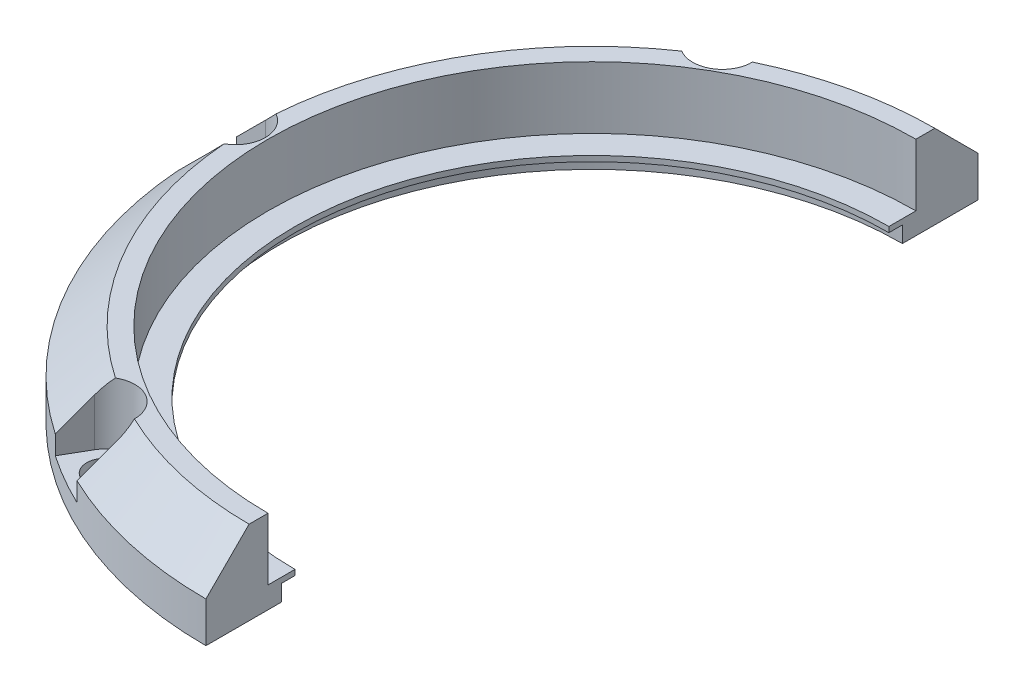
ISO-10303-21;
HEADER;
FILE_DESCRIPTION(('STEP AP214'),'2;1');
FILE_NAME('part.step','',(''),(''),'','','');
FILE_SCHEMA(('AUTOMOTIVE_DESIGN { 1 0 10303 214 1 1 1 1 }'));
ENDSEC;
DATA;
#1=APPLICATION_CONTEXT('core data for automotive mechanical design processes');
#2=APPLICATION_PROTOCOL_DEFINITION('international standard','automotive_design',2000,#1);
#3=PRODUCT_CONTEXT('',#1,'mechanical');
#4=PRODUCT('Part','Part','',(#3));
#5=PRODUCT_RELATED_PRODUCT_CATEGORY('part','',(#4));
#6=PRODUCT_DEFINITION_FORMATION('','',#4);
#7=PRODUCT_DEFINITION_CONTEXT('part definition',#1,'design');
#8=PRODUCT_DEFINITION('design','',#6,#7);
#9=PRODUCT_DEFINITION_SHAPE('','',#8);
#10=(LENGTH_UNIT() NAMED_UNIT(*) SI_UNIT(.MILLI.,.METRE.));
#11=(NAMED_UNIT(*) PLANE_ANGLE_UNIT() SI_UNIT($,.RADIAN.));
#12=(NAMED_UNIT(*) SI_UNIT($,.STERADIAN.) SOLID_ANGLE_UNIT());
#13=UNCERTAINTY_MEASURE_WITH_UNIT(LENGTH_MEASURE(1.E-05),#10,'distance_accuracy_value','');
#14=(GEOMETRIC_REPRESENTATION_CONTEXT(3) GLOBAL_UNCERTAINTY_ASSIGNED_CONTEXT((#13)) GLOBAL_UNIT_ASSIGNED_CONTEXT((#10,
#11,#12)) REPRESENTATION_CONTEXT('',''));
#15=CARTESIAN_POINT('',(0.,0.,0.));
#16=DIRECTION('',(0.,0.,1.));
#17=DIRECTION('',(1.,0.,0.));
#18=AXIS2_PLACEMENT_3D('',#15,#16,#17);
#19=CARTESIAN_POINT('',(0.,-10.51,-144.));
#20=DIRECTION('',(-1.,0.,0.));
#21=DIRECTION('',(0.,0.,1.));
#22=AXIS2_PLACEMENT_3D('',#19,#20,#21);
#23=PLANE('',#22);
#24=DIRECTION('',(0.,0.707106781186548,-0.707106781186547));
#25=VECTOR('',#24,1.);
#26=CARTESIAN_POINT('',(0.,68.5,-72.5));
#27=LINE('',#26,#25);
#28=CARTESIAN_POINT('',(0.,5.,-9.));
#29=VERTEX_POINT('',#28);
#30=CARTESIAN_POINT('',(0.,-3.,-1.));
#31=VERTEX_POINT('',#30);
#32=EDGE_CURVE('E305',#29,#31,#27,.F.);
#33=ORIENTED_EDGE('',*,*,#32,.T.);
#34=DIRECTION('',(0.,-1.,0.));
#35=VECTOR('',#34,1.);
#36=CARTESIAN_POINT('',(0.,-10.5,-1.00000000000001));
#37=LINE('',#36,#35);
#38=CARTESIAN_POINT('',(0.,-10.5,-1.));
#39=VERTEX_POINT('',#38);
#40=EDGE_CURVE('E308',#31,#39,#37,.T.);
#41=ORIENTED_EDGE('',*,*,#40,.T.);
#42=DIRECTION('',(0.,0.,-1.));
#43=VECTOR('',#42,1.);
#44=CARTESIAN_POINT('',(0.,-10.5,-1000.));
#45=LINE('',#44,#43);
#46=CARTESIAN_POINT('',(0.,-10.5,-15.));
#47=VERTEX_POINT('',#46);
#48=EDGE_CURVE('E467',#39,#47,#45,.T.);
#49=ORIENTED_EDGE('',*,*,#48,.T.);
#50=DIRECTION('',(0.,-1.,0.));
#51=VECTOR('',#50,1.);
#52=CARTESIAN_POINT('',(0.,-7.5,-15.));
#53=LINE('',#52,#51);
#54=CARTESIAN_POINT('',(0.,-7.5,-15.));
#55=VERTEX_POINT('',#54);
#56=EDGE_CURVE('E462',#55,#47,#53,.T.);
#57=ORIENTED_EDGE('',*,*,#56,.F.);
#58=DIRECTION('',(0.,0.,-1.));
#59=VECTOR('',#58,1.);
#60=CARTESIAN_POINT('',(0.,-7.5,-72.5));
#61=LINE('',#60,#59);
#62=CARTESIAN_POINT('',(0.,-7.5,-17.5));
#63=VERTEX_POINT('',#62);
#64=EDGE_CURVE('E26',#55,#63,#61,.T.);
#65=ORIENTED_EDGE('',*,*,#64,.T.);
#66=DIRECTION('',(0.,-1.,0.));
#67=VECTOR('',#66,1.);
#68=CARTESIAN_POINT('',(0.,-10.5,-17.5));
#69=LINE('',#68,#67);
#70=CARTESIAN_POINT('',(0.,-6.5,-17.5));
#71=VERTEX_POINT('',#70);
#72=EDGE_CURVE('E34',#63,#71,#69,.F.);
#73=ORIENTED_EDGE('',*,*,#72,.T.);
#74=DIRECTION('',(0.,0.,1.));
#75=VECTOR('',#74,1.);
#76=CARTESIAN_POINT('',(0.,-6.5,-12.5));
#77=LINE('',#76,#75);
#78=CARTESIAN_POINT('',(0.,-6.5,-12.5));
#79=VERTEX_POINT('',#78);
#80=EDGE_CURVE('E479',#71,#79,#77,.T.);
#81=ORIENTED_EDGE('',*,*,#80,.T.);
#82=DIRECTION('',(0.,-1.,0.));
#83=VECTOR('',#82,1.);
#84=CARTESIAN_POINT('',(0.,-10.5,-12.5));
#85=LINE('',#84,#83);
#86=CARTESIAN_POINT('',(0.,5.,-12.5));
#87=VERTEX_POINT('',#86);
#88=EDGE_CURVE('E485',#79,#87,#85,.F.);
#89=ORIENTED_EDGE('',*,*,#88,.T.);
#90=DIRECTION('',(0.,0.,1.));
#91=VECTOR('',#90,1.);
#92=CARTESIAN_POINT('',(0.,5.,-9.));
#93=LINE('',#92,#91);
#94=EDGE_CURVE('E311',#87,#29,#93,.T.);
#95=ORIENTED_EDGE('',*,*,#94,.T.);
#96=EDGE_LOOP('',(#33,#41,#49,#57,#65,#73,#81,#89,#95));
#97=FACE_BOUND('',#96,.T.);
#98=ADVANCED_FACE('F17',(#97),#23,.F.);
#99=DIRECTION('',(0.,-0.707106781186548,-0.707106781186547));
#100=VECTOR('',#99,1.);
#101=CARTESIAN_POINT('',(0.,68.5,-72.5));
#102=LINE('',#101,#100);
#103=CARTESIAN_POINT('',(0.,-3.,-144.));
#104=VERTEX_POINT('',#103);
#105=CARTESIAN_POINT('',(0.,5.,-136.));
#106=VERTEX_POINT('',#105);
#107=EDGE_CURVE('E21',#104,#106,#102,.F.);
#108=ORIENTED_EDGE('',*,*,#107,.T.);
#109=CARTESIAN_POINT('',(0.,5.,-132.5));
#110=VERTEX_POINT('',#109);
#111=EDGE_CURVE('E468',#106,#110,#93,.T.);
#112=ORIENTED_EDGE('',*,*,#111,.T.);
#113=DIRECTION('',(0.,-1.,0.));
#114=VECTOR('',#113,1.);
#115=CARTESIAN_POINT('',(0.,-10.5,-132.5));
#116=LINE('',#115,#114);
#117=CARTESIAN_POINT('',(0.,-6.5,-132.5));
#118=VERTEX_POINT('',#117);
#119=EDGE_CURVE('E482',#110,#118,#116,.T.);
#120=ORIENTED_EDGE('',*,*,#119,.T.);
#121=CARTESIAN_POINT('',(0.,-6.5,-127.5));
#122=VERTEX_POINT('',#121);
#123=EDGE_CURVE('E470',#118,#122,#77,.T.);
#124=ORIENTED_EDGE('',*,*,#123,.T.);
#125=DIRECTION('',(0.,-1.,0.));
#126=VECTOR('',#125,1.);
#127=CARTESIAN_POINT('',(0.,-10.5,-127.5));
#128=LINE('',#127,#126);
#129=CARTESIAN_POINT('',(0.,-7.5,-127.5));
#130=VERTEX_POINT('',#129);
#131=EDGE_CURVE('E474',#122,#130,#128,.T.);
#132=ORIENTED_EDGE('',*,*,#131,.T.);
#133=CARTESIAN_POINT('',(0.,-7.5,-130.));
#134=VERTEX_POINT('',#133);
#135=EDGE_CURVE('E11',#130,#134,#61,.T.);
#136=ORIENTED_EDGE('',*,*,#135,.T.);
#137=DIRECTION('',(0.,-1.,0.));
#138=VECTOR('',#137,1.);
#139=CARTESIAN_POINT('',(0.,-7.5,-130.));
#140=LINE('',#139,#138);
#141=CARTESIAN_POINT('',(0.,-10.5,-130.));
#142=VERTEX_POINT('',#141);
#143=EDGE_CURVE('E472',#142,#134,#140,.F.);
#144=ORIENTED_EDGE('',*,*,#143,.F.);
#145=CARTESIAN_POINT('',(0.,-10.5,-144.));
#146=VERTEX_POINT('',#145);
#147=EDGE_CURVE('E475',#142,#146,#45,.T.);
#148=ORIENTED_EDGE('',*,*,#147,.T.);
#149=DIRECTION('',(0.,-1.,0.));
#150=VECTOR('',#149,1.);
#151=CARTESIAN_POINT('',(0.,-10.5,-144.));
#152=LINE('',#151,#150);
#153=EDGE_CURVE('E314',#146,#104,#152,.F.);
#154=ORIENTED_EDGE('',*,*,#153,.T.);
#155=EDGE_LOOP('',(#108,#112,#120,#124,#132,#136,#144,#148,#154));
#156=FACE_BOUND('',#155,.T.);
#157=ADVANCED_FACE('F19',(#156),#23,.F.);
#158=CARTESIAN_POINT('',(0.,-10.5,-72.5));
#159=DIRECTION('',(0.,-1.,0.));
#160=DIRECTION('',(0.,0.,-1.));
#161=AXIS2_PLACEMENT_3D('',#158,#159,#160);
#162=CYLINDRICAL_SURFACE('',#161,55.);
#163=ORIENTED_EDGE('',*,*,#131,.F.);
#164=CARTESIAN_POINT('',(0.,-6.5,-72.5));
#165=DIRECTION('',(0.,-1.,0.));
#166=DIRECTION('',(0.,0.,-1.));
#167=AXIS2_PLACEMENT_3D('',#164,#165,#166);
#168=CIRCLE('',#167,55.);
#169=EDGE_CURVE('E353',#71,#122,#168,.T.);
#170=ORIENTED_EDGE('',*,*,#169,.F.);
#171=ORIENTED_EDGE('',*,*,#72,.F.);
#172=CARTESIAN_POINT('',(0.,-7.5,-72.5));
#173=DIRECTION('',(0.,-1.,0.));
#174=DIRECTION('',(1.,0.,0.));
#175=AXIS2_PLACEMENT_3D('',#172,#173,#174);
#176=CIRCLE('',#175,55.);
#177=EDGE_CURVE('E463',#63,#130,#176,.T.);
#178=ORIENTED_EDGE('',*,*,#177,.T.);
#179=EDGE_LOOP('',(#163,#170,#171,#178));
#180=FACE_BOUND('',#179,.T.);
#181=ADVANCED_FACE('F273',(#180),#162,.F.);
#182=CARTESIAN_POINT('',(0.,-3.,-72.5));
#183=DIRECTION('',(0.,-1.,0.));
#184=DIRECTION('',(0.,0.,-1.));
#185=AXIS2_PLACEMENT_3D('',#182,#183,#184);
#186=CONICAL_SURFACE('',#185,71.5,0.785398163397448);
#187=ORIENTED_EDGE('',*,*,#107,.F.);
#188=CARTESIAN_POINT('',(0.,-3.,-72.5));
#189=DIRECTION('',(0.,-1.,0.));
#190=DIRECTION('',(0.,0.,-1.));
#191=AXIS2_PLACEMENT_3D('',#188,#189,#190);
#192=CIRCLE('',#191,71.5);
#193=CARTESIAN_POINT('',(-30.8809341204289,-3.,-136.98734688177));
#194=VERTEX_POINT('',#193);
#195=EDGE_CURVE('E326',#194,#104,#192,.T.);
#196=ORIENTED_EDGE('',*,*,#195,.F.);
#197=CARTESIAN_POINT('',(-30.8810344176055,-3.0002,-136.987520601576));
#198=CARTESIAN_POINT('',(-30.4403735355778,-2.12148155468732,-136.224273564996));
#199=CARTESIAN_POINT('',(-29.999685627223,-1.24281733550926,-135.460979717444));
#200=CARTESIAN_POINT('',(-29.1182557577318,0.514402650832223,-133.934298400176));
#201=CARTESIAN_POINT('',(-28.6775137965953,1.3929584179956,-133.17091093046));
#202=CARTESIAN_POINT('',(-28.2367448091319,2.27145995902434,-132.407476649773));
#203=B_SPLINE_CURVE_WITH_KNOTS('',3,(#197,#198,#199,#200,#201,#202),.UNSPECIFIED.,.F.,.F.,(4,2,
4),(0.,3.7336131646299,7.46722633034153),.UNSPECIFIED.);
#204=CARTESIAN_POINT('',(-28.2368602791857,2.27122981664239,-132.407676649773));
#205=VERTEX_POINT('',#204);
#206=EDGE_CURVE('E358',#194,#205,#203,.T.);
#207=ORIENTED_EDGE('',*,*,#206,.T.);
#208=CARTESIAN_POINT('',(-28.2369757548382,2.27099967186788,-132.407876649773));
#209=CARTESIAN_POINT('',(-28.179010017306,2.38653079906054,-132.307475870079));
#210=CARTESIAN_POINT('',(-28.1242922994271,2.50219936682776,-132.20539215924));
#211=CARTESIAN_POINT('',(-28.0214365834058,2.73361073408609,-131.998042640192));
#212=CARTESIAN_POINT('',(-27.9732986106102,2.84935353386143,-131.892776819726));
#213=CARTESIAN_POINT('',(-27.8396492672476,3.19440609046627,-131.574314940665));
#214=CARTESIAN_POINT('',(-27.7639059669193,3.42352923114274,-131.356724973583));
#215=CARTESIAN_POINT('',(-27.6397802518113,3.87931299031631,-130.911277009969));
#216=CARTESIAN_POINT('',(-27.5914017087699,4.10597325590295,-130.683417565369));
#217=CARTESIAN_POINT('',(-27.5404716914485,4.44330915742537,-130.334101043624));
#218=CARTESIAN_POINT('',(-27.5270912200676,4.55578485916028,-130.215888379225));
#219=CARTESIAN_POINT('',(-27.5079987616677,4.77921615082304,-129.977387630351));
#220=CARTESIAN_POINT('',(-27.5022881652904,4.89017146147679,-129.857099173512));
#221=CARTESIAN_POINT('',(-27.5005557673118,5.00019999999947,-129.735863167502));
#222=B_SPLINE_CURVE_WITH_KNOTS('',3,(#208,#209,#210,#211,#212,#213,#214,#215,#216,#217,#218,
#219,#220,#221),.UNSPECIFIED.,.F.,.F.,(4,2,2,2,2,2,4),(0.,0.490926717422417,0.981855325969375,
1.955288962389,2.92886029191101,3.41984219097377,3.91091309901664),.UNSPECIFIED.);
#223=CARTESIAN_POINT('',(-27.5005589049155,5.,-129.736083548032));
#224=VERTEX_POINT('',#223);
#225=EDGE_CURVE('E189',#205,#224,#222,.T.);
#226=ORIENTED_EDGE('',*,*,#225,.T.);
#227=CARTESIAN_POINT('',(0.,5.,-72.5));
#228=DIRECTION('',(0.,-1.,0.));
#229=DIRECTION('',(0.,0.,-1.));
#230=AXIS2_PLACEMENT_3D('',#227,#228,#229);
#231=CIRCLE('',#230,63.5);
#232=EDGE_CURVE('E338',#224,#106,#231,.T.);
#233=ORIENTED_EDGE('',*,*,#232,.T.);
#234=EDGE_LOOP('',(#187,#196,#207,#226,#233));
#235=FACE_BOUND('',#234,.T.);
#236=ADVANCED_FACE('F259',(#235),#186,.T.);
#237=CARTESIAN_POINT('',(-63.3181818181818,5.,-77.3018591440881));
#238=VERTEX_POINT('',#237);
#239=CARTESIAN_POINT('',(-35.8176229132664,5.,-124.934224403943));
#240=VERTEX_POINT('',#239);
#241=EDGE_CURVE('E341',#238,#240,#231,.T.);
#242=ORIENTED_EDGE('',*,*,#241,.T.);
#243=CARTESIAN_POINT('',(-35.8174336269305,5.0002,-124.934111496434));
#244=CARTESIAN_POINT('',(-35.9215672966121,4.89016468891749,-124.996233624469));
#245=CARTESIAN_POINT('',(-36.0228909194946,4.77920249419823,-125.061327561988));
#246=CARTESIAN_POINT('',(-36.2199038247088,4.55575727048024,-125.197121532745));
#247=CARTESIAN_POINT('',(-36.3155941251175,4.44327452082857,-125.267820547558));
#248=CARTESIAN_POINT('',(-36.592660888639,4.10591764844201,-125.486600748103));
#249=CARTESIAN_POINT('',(-36.7658121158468,3.8792432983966,-125.642438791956));
#250=CARTESIAN_POINT('',(-37.0895325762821,3.42343132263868,-125.972683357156));
#251=CARTESIAN_POINT('',(-37.2401050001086,3.19429404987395,-126.147087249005));
#252=CARTESIAN_POINT('',(-37.4490827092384,2.84922032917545,-126.422083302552));
#253=CARTESIAN_POINT('',(-37.5161783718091,2.73347039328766,-126.516412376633));
#254=CARTESIAN_POINT('',(-37.6443232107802,2.50204485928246,-126.709178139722));
#255=CARTESIAN_POINT('',(-37.7053724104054,2.3863692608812,-126.807614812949));
#256=CARTESIAN_POINT('',(-37.7633397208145,2.27083117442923,-126.908023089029));
#257=B_SPLINE_CURVE_WITH_KNOTS('',3,(#243,#244,#245,#246,#247,#248,#249,#250,#251,#252,#253,
#254,#255,#256),.UNSPECIFIED.,.F.,.F.,(4,2,2,2,2,2,4),(0.,0.491101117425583,0.982113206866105,
1.95574343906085,2.92923595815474,3.42019474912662,3.91115165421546),.UNSPECIFIED.);
#258=CARTESIAN_POINT('',(-37.7631397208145,2.27122981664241,-126.907676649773));
#259=VERTEX_POINT('',#258);
#260=EDGE_CURVE('E383',#240,#259,#257,.T.);
#261=ORIENTED_EDGE('',*,*,#260,.T.);
#262=CARTESIAN_POINT('',(-37.7630242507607,2.27145995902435,-126.907476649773));
#263=CARTESIAN_POINT('',(-38.2037932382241,1.3929584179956,-127.67091093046));
#264=CARTESIAN_POINT('',(-38.6445351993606,0.514402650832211,-128.434298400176));
#265=CARTESIAN_POINT('',(-39.5259650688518,-1.24281733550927,-129.960979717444));
#266=CARTESIAN_POINT('',(-39.9666529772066,-2.12148155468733,-130.724273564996));
#267=CARTESIAN_POINT('',(-40.4073138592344,-3.0002,-131.487520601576));
#268=B_SPLINE_CURVE_WITH_KNOTS('',3,(#262,#263,#264,#265,#266,#267),.UNSPECIFIED.,.F.,.F.,(4,2,
4),(0.,3.73361316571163,7.46722633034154),.UNSPECIFIED.);
#269=CARTESIAN_POINT('',(-40.4072135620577,-3.,-131.48734688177));
#270=VERTEX_POINT('',#269);
#271=EDGE_CURVE('E364',#259,#270,#268,.T.);
#272=ORIENTED_EDGE('',*,*,#271,.T.);
#273=CARTESIAN_POINT('',(-71.2881476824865,-3.,-78.));
#274=VERTEX_POINT('',#273);
#275=EDGE_CURVE('E331',#274,#270,#192,.T.);
#276=ORIENTED_EDGE('',*,*,#275,.F.);
#277=CARTESIAN_POINT('',(-80.8781602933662,-12.5649542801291,-77.9999999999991));
#278=CARTESIAN_POINT('',(-78.8401535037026,-10.5316539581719,-77.9999999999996));
#279=CARTESIAN_POINT('',(-76.8019801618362,-8.49852053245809,-77.9999999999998));
#280=CARTESIAN_POINT('',(-72.7251831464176,-4.43270559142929,-78.));
#281=CARTESIAN_POINT('',(-70.6865594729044,-2.40002407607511,-78.));
#282=CARTESIAN_POINT('',(-66.6087441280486,1.6647693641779,-78.));
#283=CARTESIAN_POINT('',(-64.5695524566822,3.69688128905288,-78.));
#284=CARTESIAN_POINT('',(-60.4903984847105,7.76033186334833,-78.0000000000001));
#285=CARTESIAN_POINT('',(-58.4504361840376,9.79167051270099,-78.0000000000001));
#286=CARTESIAN_POINT('',(-56.4099873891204,11.8225205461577,-78.));
#287=B_SPLINE_CURVE_WITH_KNOTS('',3,(#277,#278,#279,#280,#281,#282,#283,#284,#285,#286),
.UNSPECIFIED.,.F.,.F.,(4,2,2,2,4),(0.,8.63655240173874,17.2731040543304,25.9096560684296,
34.5462088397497),.UNSPECIFIED.);
#288=CARTESIAN_POINT('',(-66.,2.27122981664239,-78.));
#289=VERTEX_POINT('',#288);
#290=EDGE_CURVE('E495',#274,#289,#287,.T.);
#291=ORIENTED_EDGE('',*,*,#290,.T.);
#292=CARTESIAN_POINT('',(-66.0002,2.27103050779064,-77.9999999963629));
#293=CARTESIAN_POINT('',(-65.8842688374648,2.38656036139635,-77.9999987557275));
#294=CARTESIAN_POINT('',(-65.768504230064,2.50222764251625,-77.9963432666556));
#295=CARTESIAN_POINT('',(-65.5375091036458,2.73363641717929,-77.9817432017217));
#296=CARTESIAN_POINT('',(-65.4222785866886,2.84937791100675,-77.9707985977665));
#297=CARTESIAN_POINT('',(-65.07966180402,3.19442659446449,-77.9273104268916));
#298=CARTESIAN_POINT('',(-64.8533543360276,3.42354714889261,-77.8841107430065));
#299=CARTESIAN_POINT('',(-64.4055274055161,3.87932574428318,-77.7688827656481));
#300=CARTESIAN_POINT('',(-64.1840086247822,4.10598343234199,-77.6968503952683));
#301=CARTESIAN_POINT('',(-63.856030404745,4.44331549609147,-77.5662997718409));
#302=CARTESIAN_POINT('',(-63.7469662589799,4.55578990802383,-77.5187816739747));
#303=CARTESIAN_POINT('',(-63.5308748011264,4.77921865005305,-77.416066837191));
#304=CARTESIAN_POINT('',(-63.4238478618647,4.89017270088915,-77.3608687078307));
#305=CARTESIAN_POINT('',(-63.317989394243,5.00019999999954,-77.3017516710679));
#306=B_SPLINE_CURVE_WITH_KNOTS('',3,(#292,#293,#294,#295,#296,#297,#298,#299,#300,#301,#302,
#303,#304,#305),.UNSPECIFIED.,.F.,.F.,(4,2,2,2,2,2,4),(0.,0.490921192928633,0.981844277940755,
1.95526713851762,2.92882768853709,3.41980406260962,3.91086944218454),.UNSPECIFIED.);
#307=EDGE_CURVE('E419',#289,#238,#306,.T.);
#308=ORIENTED_EDGE('',*,*,#307,.T.);
#309=EDGE_LOOP('',(#242,#261,#272,#276,#291,#308));
#310=FACE_BOUND('',#309,.T.);
#311=ADVANCED_FACE('F491',(#310),#186,.T.);
#312=CARTESIAN_POINT('',(-35.8176229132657,5.,-20.0657755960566));
#313=VERTEX_POINT('',#312);
#314=CARTESIAN_POINT('',(-63.3181818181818,5.,-67.6981408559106));
#315=VERTEX_POINT('',#314);
#316=EDGE_CURVE('E337',#313,#315,#231,.T.);
#317=ORIENTED_EDGE('',*,*,#316,.T.);
#318=CARTESIAN_POINT('',(-63.3179893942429,5.0001999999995,-67.6982483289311));
#319=CARTESIAN_POINT('',(-63.4238478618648,4.89017270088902,-67.6391312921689));
#320=CARTESIAN_POINT('',(-63.5308748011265,4.77921865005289,-67.5839331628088));
#321=CARTESIAN_POINT('',(-63.7469662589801,4.55578990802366,-67.4812183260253));
#322=CARTESIAN_POINT('',(-63.8560304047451,4.44331549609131,-67.433700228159));
#323=CARTESIAN_POINT('',(-64.1840086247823,4.10598343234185,-67.3031496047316));
#324=CARTESIAN_POINT('',(-64.4055274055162,3.87932574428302,-67.2311172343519));
#325=CARTESIAN_POINT('',(-64.8533543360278,3.42354714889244,-67.1158892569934));
#326=CARTESIAN_POINT('',(-65.0796618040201,3.19442659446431,-67.0726895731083));
#327=CARTESIAN_POINT('',(-65.4222785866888,2.84937791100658,-67.0292014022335));
#328=CARTESIAN_POINT('',(-65.537509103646,2.73363641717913,-67.0182567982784));
#329=CARTESIAN_POINT('',(-65.7685042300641,2.50222764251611,-67.0036567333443));
#330=CARTESIAN_POINT('',(-65.8842688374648,2.38656036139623,-67.000001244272));
#331=CARTESIAN_POINT('',(-66.0002,2.27103050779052,-67.0000000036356));
#332=B_SPLINE_CURVE_WITH_KNOTS('',3,(#318,#319,#320,#321,#322,#323,#324,#325,#326,#327,#328,
#329,#330,#331),.UNSPECIFIED.,.F.,.F.,(4,2,2,2,2,2,4),(0.,0.491065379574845,0.982041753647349,
1.95560230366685,2.92902516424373,3.41994824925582,3.91086944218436),.UNSPECIFIED.);
#333=CARTESIAN_POINT('',(-66.,2.2712298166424,-67.));
#334=VERTEX_POINT('',#333);
#335=EDGE_CURVE('E423',#315,#334,#332,.T.);
#336=ORIENTED_EDGE('',*,*,#335,.T.);
#337=CARTESIAN_POINT('',(-56.4099873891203,11.8225205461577,-67.));
#338=CARTESIAN_POINT('',(-58.4504361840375,9.79167051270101,-67.0000000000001));
#339=CARTESIAN_POINT('',(-60.4903984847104,7.76033186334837,-67.0000000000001));
#340=CARTESIAN_POINT('',(-64.5695524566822,3.69688128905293,-67.));
#341=CARTESIAN_POINT('',(-66.6087441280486,1.66476936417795,-67.));
#342=CARTESIAN_POINT('',(-70.6865594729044,-2.40002407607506,-67.));
#343=CARTESIAN_POINT('',(-72.7251831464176,-4.43270559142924,-67.));
#344=CARTESIAN_POINT('',(-76.8019801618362,-8.49852053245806,-66.9999999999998));
#345=CARTESIAN_POINT('',(-78.8401535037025,-10.5316539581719,-66.9999999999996));
#346=CARTESIAN_POINT('',(-80.8781602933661,-12.5649542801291,-66.9999999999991));
#347=B_SPLINE_CURVE_WITH_KNOTS('',3,(#337,#338,#339,#340,#341,#342,#343,#344,#345,#346),
.UNSPECIFIED.,.F.,.F.,(4,2,2,2,4),(0.,8.6365527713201,17.2731047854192,25.9096564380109,
34.5462088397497),.UNSPECIFIED.);
#348=CARTESIAN_POINT('',(-71.2881476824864,-3.,-66.9999999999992));
#349=VERTEX_POINT('',#348);
#350=EDGE_CURVE('E496',#334,#349,#347,.T.);
#351=ORIENTED_EDGE('',*,*,#350,.T.);
#352=CARTESIAN_POINT('',(-40.4072135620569,-3.,-13.5126531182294));
#353=VERTEX_POINT('',#352);
#354=EDGE_CURVE('E324',#353,#349,#192,.T.);
#355=ORIENTED_EDGE('',*,*,#354,.F.);
#356=CARTESIAN_POINT('',(-40.4073138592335,-3.0002,-13.5124793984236));
#357=CARTESIAN_POINT('',(-39.9666529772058,-2.12148155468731,-14.2757264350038));
#358=CARTESIAN_POINT('',(-39.525965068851,-1.24281733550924,-15.0390202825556));
#359=CARTESIAN_POINT('',(-38.6445351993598,0.514402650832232,-16.5657015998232));
#360=CARTESIAN_POINT('',(-38.2037932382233,1.3929584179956,-17.3290890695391));
#361=CARTESIAN_POINT('',(-37.7630242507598,2.27145995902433,-18.0925233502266));
#362=B_SPLINE_CURVE_WITH_KNOTS('',3,(#356,#357,#358,#359,#360,#361),.UNSPECIFIED.,.F.,.F.,(4,2,
4),(0.,3.73361316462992,7.46722633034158),.UNSPECIFIED.);
#363=CARTESIAN_POINT('',(-37.7631397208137,2.27122981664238,-18.0923233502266));
#364=VERTEX_POINT('',#363);
#365=EDGE_CURVE('E397',#353,#364,#362,.T.);
#366=ORIENTED_EDGE('',*,*,#365,.T.);
#367=CARTESIAN_POINT('',(-37.7633397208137,2.27083117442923,-18.0919769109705));
#368=CARTESIAN_POINT('',(-37.7053724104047,2.38636926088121,-18.1923851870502));
#369=CARTESIAN_POINT('',(-37.6443232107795,2.50204485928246,-18.2908218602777));
#370=CARTESIAN_POINT('',(-37.5161783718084,2.73347039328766,-18.4835876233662));
#371=CARTESIAN_POINT('',(-37.4490827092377,2.84922032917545,-18.5779166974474));
#372=CARTESIAN_POINT('',(-37.2401050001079,3.19429404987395,-18.8529127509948));
#373=CARTESIAN_POINT('',(-37.0895325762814,3.42343132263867,-19.027316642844));
#374=CARTESIAN_POINT('',(-36.7658121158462,3.87924329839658,-19.3575612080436));
#375=CARTESIAN_POINT('',(-36.5926608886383,4.105917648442,-19.5133992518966));
#376=CARTESIAN_POINT('',(-36.3155941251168,4.44327452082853,-19.732179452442));
#377=CARTESIAN_POINT('',(-36.2199038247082,4.5557572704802,-19.8028784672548));
#378=CARTESIAN_POINT('',(-36.022890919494,4.77920249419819,-19.9386724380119));
#379=CARTESIAN_POINT('',(-35.9215672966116,4.89016468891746,-20.0037663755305));
#380=CARTESIAN_POINT('',(-35.81743362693,5.0002,-20.0658885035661));
#381=B_SPLINE_CURVE_WITH_KNOTS('',3,(#367,#368,#369,#370,#371,#372,#373,#374,#375,#376,#377,
#378,#379,#380),.UNSPECIFIED.,.F.,.F.,(4,2,2,2,2,2,4),(0.,0.490956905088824,0.981915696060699,
1.95540821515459,2.92903844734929,3.42005053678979,3.91115165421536),.UNSPECIFIED.);
#382=EDGE_CURVE('E192',#364,#313,#381,.T.);
#383=ORIENTED_EDGE('',*,*,#382,.T.);
#384=EDGE_LOOP('',(#317,#336,#351,#355,#366,#383));
#385=FACE_BOUND('',#384,.T.);
#386=ADVANCED_FACE('F522',(#385),#186,.T.);
#387=ORIENTED_EDGE('',*,*,#32,.F.);
#388=CARTESIAN_POINT('',(-27.5005589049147,5.,-15.2639164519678));
#389=VERTEX_POINT('',#388);
#390=EDGE_CURVE('E334',#29,#389,#231,.T.);
#391=ORIENTED_EDGE('',*,*,#390,.T.);
#392=CARTESIAN_POINT('',(-27.5005557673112,5.00019999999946,-15.2641368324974));
#393=CARTESIAN_POINT('',(-27.5022881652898,4.89017146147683,-15.1429008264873));
#394=CARTESIAN_POINT('',(-27.507998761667,4.7792161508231,-15.0226123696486));
#395=CARTESIAN_POINT('',(-27.5270912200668,4.55578485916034,-14.7841116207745));
#396=CARTESIAN_POINT('',(-27.5404716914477,4.44330915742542,-14.665898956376));
#397=CARTESIAN_POINT('',(-27.5914017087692,4.10597325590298,-14.3165824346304));
#398=CARTESIAN_POINT('',(-27.6397802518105,3.87931299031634,-14.0887229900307));
#399=CARTESIAN_POINT('',(-27.7639059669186,3.42352923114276,-13.643275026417));
#400=CARTESIAN_POINT('',(-27.8396492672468,3.19440609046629,-13.4256850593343));
#401=CARTESIAN_POINT('',(-27.9732986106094,2.84935353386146,-13.1072231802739));
#402=CARTESIAN_POINT('',(-28.0214365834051,2.73361073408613,-13.001957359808));
#403=CARTESIAN_POINT('',(-28.1242922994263,2.5021993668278,-12.7946078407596));
#404=CARTESIAN_POINT('',(-28.1790100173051,2.38653079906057,-12.6925241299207));
#405=CARTESIAN_POINT('',(-28.2369757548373,2.27099967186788,-12.5921233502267));
#406=B_SPLINE_CURVE_WITH_KNOTS('',3,(#392,#393,#394,#395,#396,#397,#398,#399,#400,#401,#402,
#403,#404,#405),.UNSPECIFIED.,.F.,.F.,(4,2,2,2,2,2,4),(0.,0.491070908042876,0.982052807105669,
1.95562413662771,2.92905777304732,3.41998638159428,3.91091309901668),.UNSPECIFIED.);
#407=CARTESIAN_POINT('',(-28.2368602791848,2.27122981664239,-12.5923233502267));
#408=VERTEX_POINT('',#407);
#409=EDGE_CURVE('E254',#389,#408,#406,.T.);
#410=ORIENTED_EDGE('',*,*,#409,.T.);
#411=CARTESIAN_POINT('',(-28.236744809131,2.27145995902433,-12.5925233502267));
#412=CARTESIAN_POINT('',(-28.6775137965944,1.39295841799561,-11.8290890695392));
#413=CARTESIAN_POINT('',(-29.1182557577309,0.514402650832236,-11.0657015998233));
#414=CARTESIAN_POINT('',(-29.9996856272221,-1.24281733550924,-9.53902028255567));
#415=CARTESIAN_POINT('',(-30.4403735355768,-2.12148155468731,-8.77572643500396));
#416=CARTESIAN_POINT('',(-30.8810344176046,-3.0002,-8.01247939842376));
#417=B_SPLINE_CURVE_WITH_KNOTS('',3,(#411,#412,#413,#414,#415,#416),.UNSPECIFIED.,.F.,.F.,(4,2,
4),(0.,3.73361316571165,7.46722633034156),.UNSPECIFIED.);
#418=CARTESIAN_POINT('',(-30.880934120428,-3.,-8.01265311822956));
#419=VERTEX_POINT('',#418);
#420=EDGE_CURVE('E319',#408,#419,#417,.T.);
#421=ORIENTED_EDGE('',*,*,#420,.T.);
#422=EDGE_CURVE('E316',#31,#419,#192,.T.);
#423=ORIENTED_EDGE('',*,*,#422,.F.);
#424=EDGE_LOOP('',(#387,#391,#410,#421,#423));
#425=FACE_BOUND('',#424,.T.);
#426=ADVANCED_FACE('F317',(#425),#186,.T.);
#427=CARTESIAN_POINT('',(0.,-10.5,-72.5));
#428=DIRECTION('',(0.,-1.,0.));
#429=DIRECTION('',(0.,0.,-1.));
#430=AXIS2_PLACEMENT_3D('',#427,#428,#429);
#431=CYLINDRICAL_SURFACE('',#430,71.5);
#432=ORIENTED_EDGE('',*,*,#153,.F.);
#433=CARTESIAN_POINT('',(0.,-10.5,-72.5));
#434=DIRECTION('',(0.,-1.,0.));
#435=DIRECTION('',(0.,0.,-1.));
#436=AXIS2_PLACEMENT_3D('',#433,#434,#435);
#437=CIRCLE('',#436,71.5);
#438=EDGE_CURVE('E323',#39,#146,#437,.T.);
#439=ORIENTED_EDGE('',*,*,#438,.F.);
#440=ORIENTED_EDGE('',*,*,#40,.F.);
#441=ORIENTED_EDGE('',*,*,#422,.T.);
#442=DIRECTION('',(0.,-1.,0.));
#443=VECTOR('',#442,1.);
#444=CARTESIAN_POINT('',(-30.880934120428,-10.5,-8.01265311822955));
#445=LINE('',#444,#443);
#446=CARTESIAN_POINT('',(-30.880934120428,-6.5,-8.01265311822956));
#447=VERTEX_POINT('',#446);
#448=EDGE_CURVE('E447',#419,#447,#445,.T.);
#449=ORIENTED_EDGE('',*,*,#448,.T.);
#450=CARTESIAN_POINT('',(0.,-6.5,-72.5));
#451=DIRECTION('',(0.,1.,0.));
#452=DIRECTION('',(-0.866025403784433,0.,0.50000000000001));
#453=AXIS2_PLACEMENT_3D('',#450,#451,#452);
#454=CIRCLE('',#453,71.5);
#455=CARTESIAN_POINT('',(-40.4072135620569,-6.5,-13.5126531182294));
#456=VERTEX_POINT('',#455);
#457=EDGE_CURVE('E239',#456,#447,#454,.T.);
#458=ORIENTED_EDGE('',*,*,#457,.F.);
#459=DIRECTION('',(0.,-1.,0.));
#460=VECTOR('',#459,1.);
#461=CARTESIAN_POINT('',(-40.4072135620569,-10.5,-13.5126531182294));
#462=LINE('',#461,#460);
#463=EDGE_CURVE('E449',#456,#353,#462,.F.);
#464=ORIENTED_EDGE('',*,*,#463,.T.);
#465=ORIENTED_EDGE('',*,*,#354,.T.);
#466=DIRECTION('',(0.,-1.,0.));
#467=VECTOR('',#466,1.);
#468=CARTESIAN_POINT('',(-71.2881476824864,-10.5,-66.9999999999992));
#469=LINE('',#468,#467);
#470=CARTESIAN_POINT('',(-71.2881476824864,-6.5,-66.9999999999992));
#471=VERTEX_POINT('',#470);
#472=EDGE_CURVE('E452',#349,#471,#469,.T.);
#473=ORIENTED_EDGE('',*,*,#472,.T.);
#474=CARTESIAN_POINT('',(0.,-6.5,-72.5));
#475=DIRECTION('',(0.,1.,0.));
#476=DIRECTION('',(-0.866025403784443,0.,-0.499999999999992));
#477=AXIS2_PLACEMENT_3D('',#474,#475,#476);
#478=CIRCLE('',#477,71.5);
#479=CARTESIAN_POINT('',(-71.2881476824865,-6.5,-78.));
#480=VERTEX_POINT('',#479);
#481=EDGE_CURVE('E226',#480,#471,#478,.T.);
#482=ORIENTED_EDGE('',*,*,#481,.F.);
#483=DIRECTION('',(0.,-1.,0.));
#484=VECTOR('',#483,1.);
#485=CARTESIAN_POINT('',(-71.2881476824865,-10.5,-78.));
#486=LINE('',#485,#484);
#487=EDGE_CURVE('E455',#480,#274,#486,.F.);
#488=ORIENTED_EDGE('',*,*,#487,.T.);
#489=ORIENTED_EDGE('',*,*,#275,.T.);
#490=DIRECTION('',(0.,-1.,0.));
#491=VECTOR('',#490,1.);
#492=CARTESIAN_POINT('',(-40.4072135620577,-10.5,-131.48734688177));
#493=LINE('',#492,#491);
#494=CARTESIAN_POINT('',(-40.4072135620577,-6.5,-131.48734688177));
#495=VERTEX_POINT('',#494);
#496=EDGE_CURVE('E458',#270,#495,#493,.T.);
#497=ORIENTED_EDGE('',*,*,#496,.T.);
#498=CARTESIAN_POINT('',(0.,-6.5,-72.5));
#499=DIRECTION('',(0.,1.,0.));
#500=DIRECTION('',(0.,0.,-1.));
#501=AXIS2_PLACEMENT_3D('',#498,#499,#500);
#502=CIRCLE('',#501,71.5);
#503=CARTESIAN_POINT('',(-30.8809341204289,-6.5,-136.98734688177));
#504=VERTEX_POINT('',#503);
#505=EDGE_CURVE('E202',#504,#495,#502,.T.);
#506=ORIENTED_EDGE('',*,*,#505,.F.);
#507=DIRECTION('',(0.,-1.,0.));
#508=VECTOR('',#507,1.);
#509=CARTESIAN_POINT('',(-30.8809341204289,-10.5,-136.98734688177));
#510=LINE('',#509,#508);
#511=EDGE_CURVE('E199',#504,#194,#510,.F.);
#512=ORIENTED_EDGE('',*,*,#511,.T.);
#513=ORIENTED_EDGE('',*,*,#195,.T.);
#514=EDGE_LOOP('',(#432,#439,#440,#441,#449,#458,#464,#465,#473,#482,#488,#489,#497,#506,#512,#513));
#515=FACE_BOUND('',#514,.T.);
#516=ADVANCED_FACE('F281',(#515),#431,.T.);
#517=CARTESIAN_POINT('',(0.,-6.5,-12.5));
#518=DIRECTION('',(0.,1.,0.));
#519=DIRECTION('',(0.,0.,1.));
#520=AXIS2_PLACEMENT_3D('',#517,#518,#519);
#521=PLANE('',#520);
#522=ORIENTED_EDGE('',*,*,#123,.F.);
#523=CARTESIAN_POINT('',(0.,-6.5,-72.5));
#524=DIRECTION('',(0.,-1.,0.));
#525=DIRECTION('',(0.,0.,-1.));
#526=AXIS2_PLACEMENT_3D('',#523,#524,#525);
#527=CIRCLE('',#526,60.);
#528=EDGE_CURVE('E350',#79,#118,#527,.T.);
#529=ORIENTED_EDGE('',*,*,#528,.F.);
#530=ORIENTED_EDGE('',*,*,#80,.F.);
#531=ORIENTED_EDGE('',*,*,#169,.T.);
#532=EDGE_LOOP('',(#522,#529,#530,#531));
#533=FACE_BOUND('',#532,.T.);
#534=ADVANCED_FACE('F277',(#533),#521,.T.);
#535=CARTESIAN_POINT('',(0.,-10.5,-72.5));
#536=DIRECTION('',(0.,-1.,0.));
#537=DIRECTION('',(0.,0.,-1.));
#538=AXIS2_PLACEMENT_3D('',#535,#536,#537);
#539=CYLINDRICAL_SURFACE('',#538,60.);
#540=ORIENTED_EDGE('',*,*,#119,.F.);
#541=CARTESIAN_POINT('',(0.,5.,-72.5));
#542=DIRECTION('',(0.,-1.,0.));
#543=DIRECTION('',(0.,0.,-1.));
#544=AXIS2_PLACEMENT_3D('',#541,#542,#543);
#545=CIRCLE('',#544,60.);
#546=EDGE_CURVE('E344',#87,#110,#545,.T.);
#547=ORIENTED_EDGE('',*,*,#546,.F.);
#548=ORIENTED_EDGE('',*,*,#88,.F.);
#549=ORIENTED_EDGE('',*,*,#528,.T.);
#550=EDGE_LOOP('',(#540,#547,#548,#549));
#551=FACE_BOUND('',#550,.T.);
#552=ADVANCED_FACE('F280',(#551),#539,.F.);
#553=CARTESIAN_POINT('',(0.,5.,-9.));
#554=DIRECTION('',(0.,1.,0.));
#555=DIRECTION('',(0.,0.,1.));
#556=AXIS2_PLACEMENT_3D('',#553,#554,#555);
#557=PLANE('',#556);
#558=ORIENTED_EDGE('',*,*,#111,.F.);
#559=ORIENTED_EDGE('',*,*,#232,.F.);
#560=CARTESIAN_POINT('',(-33.,5.,-129.657676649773));
#561=DIRECTION('',(0.,1.,0.));
#562=DIRECTION('',(0.,0.,1.));
#563=AXIS2_PLACEMENT_3D('',#560,#561,#562);
#564=CIRCLE('',#563,5.5);
#565=EDGE_CURVE('E442',#224,#240,#564,.F.);
#566=ORIENTED_EDGE('',*,*,#565,.T.);
#567=ORIENTED_EDGE('',*,*,#241,.F.);
#568=CARTESIAN_POINT('',(-66.,5.,-72.5));
#569=DIRECTION('',(0.,1.,0.));
#570=DIRECTION('',(0.,0.,1.));
#571=AXIS2_PLACEMENT_3D('',#568,#569,#570);
#572=CIRCLE('',#571,5.5);
#573=EDGE_CURVE('E440',#238,#315,#572,.F.);
#574=ORIENTED_EDGE('',*,*,#573,.T.);
#575=ORIENTED_EDGE('',*,*,#316,.F.);
#576=CARTESIAN_POINT('',(-32.9999999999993,5.,-15.3423233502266));
#577=DIRECTION('',(0.,1.,0.));
#578=DIRECTION('',(0.,0.,1.));
#579=AXIS2_PLACEMENT_3D('',#576,#577,#578);
#580=CIRCLE('',#579,5.5);
#581=EDGE_CURVE('E328',#313,#389,#580,.F.);
#582=ORIENTED_EDGE('',*,*,#581,.T.);
#583=ORIENTED_EDGE('',*,*,#390,.F.);
#584=ORIENTED_EDGE('',*,*,#94,.F.);
#585=ORIENTED_EDGE('',*,*,#546,.T.);
#586=EDGE_LOOP('',(#558,#559,#566,#567,#574,#575,#582,#583,#584,#585));
#587=FACE_BOUND('',#586,.T.);
#588=ADVANCED_FACE('F284',(#587),#557,.T.);
#589=CARTESIAN_POINT('',(74.,-10.5,-1000.));
#590=DIRECTION('',(0.,-1.,0.));
#591=DIRECTION('',(1.,0.,0.));
#592=AXIS2_PLACEMENT_3D('',#589,#590,#591);
#593=PLANE('',#592);
#594=ORIENTED_EDGE('',*,*,#48,.F.);
#595=ORIENTED_EDGE('',*,*,#438,.T.);
#596=ORIENTED_EDGE('',*,*,#147,.F.);
#597=CARTESIAN_POINT('',(0.,-10.5,-72.5));
#598=DIRECTION('',(0.,-1.,0.));
#599=DIRECTION('',(1.,0.,0.));
#600=AXIS2_PLACEMENT_3D('',#597,#598,#599);
#601=CIRCLE('',#600,57.5);
#602=EDGE_CURVE('E734',#47,#142,#601,.T.);
#603=ORIENTED_EDGE('',*,*,#602,.F.);
#604=EDGE_LOOP('',(#594,#595,#596,#603));
#605=FACE_BOUND('',#604,.T.);
#606=CARTESIAN_POINT('',(-33.,-10.5,-129.657676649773));
#607=DIRECTION('',(0.,1.,0.));
#608=DIRECTION('',(0.,0.,-1.));
#609=AXIS2_PLACEMENT_3D('',#606,#607,#608);
#610=CIRCLE('',#609,3.4);
#611=CARTESIAN_POINT('',(-33.,-10.5,-133.057676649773));
#612=VERTEX_POINT('',#611);
#613=EDGE_CURVE('E236',#612,#612,#610,.T.);
#614=ORIENTED_EDGE('',*,*,#613,.T.);
#615=EDGE_LOOP('',(#614));
#616=FACE_BOUND('',#615,.T.);
#617=CARTESIAN_POINT('',(-66.,-10.5,-72.5));
#618=DIRECTION('',(0.,1.,0.));
#619=DIRECTION('',(-0.866025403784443,0.,-0.499999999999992));
#620=AXIS2_PLACEMENT_3D('',#617,#618,#619);
#621=CIRCLE('',#620,3.4);
#622=CARTESIAN_POINT('',(-68.9444863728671,-10.5,-74.2));
#623=VERTEX_POINT('',#622);
#624=EDGE_CURVE('E743',#623,#623,#621,.T.);
#625=ORIENTED_EDGE('',*,*,#624,.T.);
#626=EDGE_LOOP('',(#625));
#627=FACE_BOUND('',#626,.T.);
#628=CARTESIAN_POINT('',(-32.9999999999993,-10.5,-15.3423233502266));
#629=DIRECTION('',(0.,1.,0.));
#630=DIRECTION('',(-0.866025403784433,0.,0.50000000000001));
#631=AXIS2_PLACEMENT_3D('',#628,#629,#630);
#632=CIRCLE('',#631,3.4);
#633=CARTESIAN_POINT('',(-35.9444863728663,-10.5,-13.6423233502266));
#634=VERTEX_POINT('',#633);
#635=EDGE_CURVE('E748',#634,#634,#632,.T.);
#636=ORIENTED_EDGE('',*,*,#635,.T.);
#637=EDGE_LOOP('',(#636));
#638=FACE_BOUND('',#637,.T.);
#639=ADVANCED_FACE('F269',(#605,#616,#627,#638),#593,.T.);
#640=CARTESIAN_POINT('',(-32.9999999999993,5.,-15.3423233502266));
#641=DIRECTION('',(0.,-1.,0.));
#642=DIRECTION('',(0.,0.,-1.));
#643=AXIS2_PLACEMENT_3D('',#640,#641,#642);
#644=CYLINDRICAL_SURFACE('',#643,5.5);
#645=ORIENTED_EDGE('',*,*,#581,.F.);
#646=ORIENTED_EDGE('',*,*,#382,.F.);
#647=DIRECTION('',(0.,-1.,0.));
#648=VECTOR('',#647,1.);
#649=CARTESIAN_POINT('',(-37.7631397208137,5.,-18.0923233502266));
#650=LINE('',#649,#648);
#651=CARTESIAN_POINT('',(-37.7631397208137,-6.5,-18.0923233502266));
#652=VERTEX_POINT('',#651);
#653=EDGE_CURVE('E223',#364,#652,#650,.T.);
#654=ORIENTED_EDGE('',*,*,#653,.T.);
#655=CARTESIAN_POINT('',(-32.9999999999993,-6.5,-15.3423233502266));
#656=DIRECTION('',(0.,1.,0.));
#657=DIRECTION('',(-0.866025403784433,0.,0.50000000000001));
#658=AXIS2_PLACEMENT_3D('',#655,#656,#657);
#659=CIRCLE('',#658,5.5);
#660=CARTESIAN_POINT('',(-28.2368602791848,-6.5,-12.5923233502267));
#661=VERTEX_POINT('',#660);
#662=EDGE_CURVE('E232',#661,#652,#659,.T.);
#663=ORIENTED_EDGE('',*,*,#662,.F.);
#664=DIRECTION('',(0.,-1.,0.));
#665=VECTOR('',#664,1.);
#666=CARTESIAN_POINT('',(-28.2368602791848,5.,-12.5923233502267));
#667=LINE('',#666,#665);
#668=EDGE_CURVE('E244',#408,#661,#667,.T.);
#669=ORIENTED_EDGE('',*,*,#668,.F.);
#670=ORIENTED_EDGE('',*,*,#409,.F.);
#671=EDGE_LOOP('',(#645,#646,#654,#663,#669,#670));
#672=FACE_BOUND('',#671,.T.);
#673=ADVANCED_FACE('F263',(#672),#644,.F.);
#674=CARTESIAN_POINT('',(-37.7631397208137,5.,-18.0923233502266));
#675=DIRECTION('',(0.866025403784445,0.,0.499999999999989));
#676=DIRECTION('',(0.499999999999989,0.,-0.866025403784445));
#677=AXIS2_PLACEMENT_3D('',#674,#675,#676);
#678=PLANE('',#677);
#679=ORIENTED_EDGE('',*,*,#463,.F.);
#680=DIRECTION('',(-0.499999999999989,0.,0.866025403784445));
#681=VECTOR('',#680,1.);
#682=CARTESIAN_POINT('',(-37.7631397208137,-6.5,-18.0923233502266));
#683=LINE('',#682,#681);
#684=EDGE_CURVE('E235',#652,#456,#683,.T.);
#685=ORIENTED_EDGE('',*,*,#684,.F.);
#686=ORIENTED_EDGE('',*,*,#653,.F.);
#687=ORIENTED_EDGE('',*,*,#365,.F.);
#688=EDGE_LOOP('',(#679,#685,#686,#687));
#689=FACE_BOUND('',#688,.T.);
#690=ADVANCED_FACE('F268',(#689),#678,.T.);
#691=CARTESIAN_POINT('',(-28.2368602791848,5.,-12.5923233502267));
#692=DIRECTION('',(-0.866025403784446,0.,-0.499999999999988));
#693=DIRECTION('',(-0.499999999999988,0.,0.866025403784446));
#694=AXIS2_PLACEMENT_3D('',#691,#692,#693);
#695=PLANE('',#694);
#696=ORIENTED_EDGE('',*,*,#668,.T.);
#697=DIRECTION('',(0.499999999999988,0.,-0.866025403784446));
#698=VECTOR('',#697,1.);
#699=CARTESIAN_POINT('',(-28.2368602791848,-6.5,-12.5923233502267));
#700=LINE('',#699,#698);
#701=EDGE_CURVE('E241',#447,#661,#700,.T.);
#702=ORIENTED_EDGE('',*,*,#701,.F.);
#703=ORIENTED_EDGE('',*,*,#448,.F.);
#704=ORIENTED_EDGE('',*,*,#420,.F.);
#705=EDGE_LOOP('',(#696,#702,#703,#704));
#706=FACE_BOUND('',#705,.T.);
#707=ADVANCED_FACE('F402',(#706),#695,.T.);
#708=CARTESIAN_POINT('',(-32.9999999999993,-6.5,-15.3423233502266));
#709=DIRECTION('',(0.,1.,0.));
#710=DIRECTION('',(-0.866025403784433,0.,0.50000000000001));
#711=AXIS2_PLACEMENT_3D('',#708,#709,#710);
#712=PLANE('',#711);
#713=CARTESIAN_POINT('',(-32.9999999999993,-6.5,-15.3423233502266));
#714=DIRECTION('',(0.,1.,0.));
#715=DIRECTION('',(-0.866025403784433,0.,0.50000000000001));
#716=AXIS2_PLACEMENT_3D('',#713,#714,#715);
#717=CIRCLE('',#716,3.4);
#718=CARTESIAN_POINT('',(-35.9444863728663,-6.5,-13.6423233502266));
#719=VERTEX_POINT('',#718);
#720=EDGE_CURVE('E213',#719,#719,#717,.T.);
#721=ORIENTED_EDGE('',*,*,#720,.F.);
#722=EDGE_LOOP('',(#721));
#723=FACE_BOUND('',#722,.T.);
#724=ORIENTED_EDGE('',*,*,#662,.T.);
#725=ORIENTED_EDGE('',*,*,#684,.T.);
#726=ORIENTED_EDGE('',*,*,#457,.T.);
#727=ORIENTED_EDGE('',*,*,#701,.T.);
#728=EDGE_LOOP('',(#724,#725,#726,#727));
#729=FACE_BOUND('',#728,.T.);
#730=ADVANCED_FACE('F406',(#723,#729),#712,.T.);
#731=CARTESIAN_POINT('',(-66.,5.,-72.5));
#732=DIRECTION('',(0.,-1.,0.));
#733=DIRECTION('',(0.,0.,-1.));
#734=AXIS2_PLACEMENT_3D('',#731,#732,#733);
#735=CYLINDRICAL_SURFACE('',#734,5.5);
#736=ORIENTED_EDGE('',*,*,#573,.F.);
#737=ORIENTED_EDGE('',*,*,#307,.F.);
#738=DIRECTION('',(0.,-1.,0.));
#739=VECTOR('',#738,1.);
#740=CARTESIAN_POINT('',(-66.,5.,-78.));
#741=LINE('',#740,#739);
#742=CARTESIAN_POINT('',(-66.,-6.5,-78.));
#743=VERTEX_POINT('',#742);
#744=EDGE_CURVE('E208',#289,#743,#741,.T.);
#745=ORIENTED_EDGE('',*,*,#744,.T.);
#746=CARTESIAN_POINT('',(-66.,-6.5,-72.5));
#747=DIRECTION('',(0.,1.,0.));
#748=DIRECTION('',(-0.866025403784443,0.,-0.499999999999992));
#749=AXIS2_PLACEMENT_3D('',#746,#747,#748);
#750=CIRCLE('',#749,5.5);
#751=CARTESIAN_POINT('',(-66.,-6.5,-67.));
#752=VERTEX_POINT('',#751);
#753=EDGE_CURVE('E219',#752,#743,#750,.T.);
#754=ORIENTED_EDGE('',*,*,#753,.F.);
#755=DIRECTION('',(0.,-1.,0.));
#756=VECTOR('',#755,1.);
#757=CARTESIAN_POINT('',(-66.,5.,-67.));
#758=LINE('',#757,#756);
#759=EDGE_CURVE('E210',#334,#752,#758,.T.);
#760=ORIENTED_EDGE('',*,*,#759,.F.);
#761=ORIENTED_EDGE('',*,*,#335,.F.);
#762=EDGE_LOOP('',(#736,#737,#745,#754,#760,#761));
#763=FACE_BOUND('',#762,.T.);
#764=ADVANCED_FACE('F410',(#763),#735,.F.);
#765=CARTESIAN_POINT('',(-66.,5.,-78.));
#766=DIRECTION('',(0.,0.,1.));
#767=DIRECTION('',(1.,0.,0.));
#768=AXIS2_PLACEMENT_3D('',#765,#766,#767);
#769=PLANE('',#768);
#770=ORIENTED_EDGE('',*,*,#487,.F.);
#771=DIRECTION('',(-1.,0.,0.));
#772=VECTOR('',#771,1.);
#773=CARTESIAN_POINT('',(-66.,-6.5,-78.));
#774=LINE('',#773,#772);
#775=EDGE_CURVE('E222',#743,#480,#774,.T.);
#776=ORIENTED_EDGE('',*,*,#775,.F.);
#777=ORIENTED_EDGE('',*,*,#744,.F.);
#778=ORIENTED_EDGE('',*,*,#290,.F.);
#779=EDGE_LOOP('',(#770,#776,#777,#778));
#780=FACE_BOUND('',#779,.T.);
#781=ADVANCED_FACE('F415',(#780),#769,.T.);
#782=CARTESIAN_POINT('',(-66.,5.,-67.));
#783=DIRECTION('',(0.,0.,-1.));
#784=DIRECTION('',(-1.,0.,0.));
#785=AXIS2_PLACEMENT_3D('',#782,#783,#784);
#786=PLANE('',#785);
#787=ORIENTED_EDGE('',*,*,#759,.T.);
#788=DIRECTION('',(1.,0.,0.));
#789=VECTOR('',#788,1.);
#790=CARTESIAN_POINT('',(-66.,-6.5,-67.));
#791=LINE('',#790,#789);
#792=EDGE_CURVE('E228',#471,#752,#791,.T.);
#793=ORIENTED_EDGE('',*,*,#792,.F.);
#794=ORIENTED_EDGE('',*,*,#472,.F.);
#795=ORIENTED_EDGE('',*,*,#350,.F.);
#796=EDGE_LOOP('',(#787,#793,#794,#795));
#797=FACE_BOUND('',#796,.T.);
#798=ADVANCED_FACE('F503',(#797),#786,.T.);
#799=CARTESIAN_POINT('',(-66.,-6.5,-72.5));
#800=DIRECTION('',(0.,1.,0.));
#801=DIRECTION('',(-0.866025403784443,0.,-0.499999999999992));
#802=AXIS2_PLACEMENT_3D('',#799,#800,#801);
#803=PLANE('',#802);
#804=CARTESIAN_POINT('',(-66.,-6.5,-72.5));
#805=DIRECTION('',(0.,1.,0.));
#806=DIRECTION('',(-0.866025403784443,0.,-0.499999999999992));
#807=AXIS2_PLACEMENT_3D('',#804,#805,#806);
#808=CIRCLE('',#807,3.4);
#809=CARTESIAN_POINT('',(-68.9444863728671,-6.5,-74.2));
#810=VERTEX_POINT('',#809);
#811=EDGE_CURVE('E746',#810,#810,#808,.T.);
#812=ORIENTED_EDGE('',*,*,#811,.F.);
#813=EDGE_LOOP('',(#812));
#814=FACE_BOUND('',#813,.T.);
#815=ORIENTED_EDGE('',*,*,#753,.T.);
#816=ORIENTED_EDGE('',*,*,#775,.T.);
#817=ORIENTED_EDGE('',*,*,#481,.T.);
#818=ORIENTED_EDGE('',*,*,#792,.T.);
#819=EDGE_LOOP('',(#815,#816,#817,#818));
#820=FACE_BOUND('',#819,.T.);
#821=ADVANCED_FACE('F379',(#814,#820),#803,.T.);
#822=CARTESIAN_POINT('',(-33.,5.,-129.657676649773));
#823=DIRECTION('',(0.,-1.,0.));
#824=DIRECTION('',(0.,0.,-1.));
#825=AXIS2_PLACEMENT_3D('',#822,#823,#824);
#826=CYLINDRICAL_SURFACE('',#825,5.5);
#827=DIRECTION('',(0.,-1.,0.));
#828=VECTOR('',#827,1.);
#829=CARTESIAN_POINT('',(-28.2368602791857,5.,-132.407676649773));
#830=LINE('',#829,#828);
#831=CARTESIAN_POINT('',(-28.2368602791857,-6.5,-132.407676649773));
#832=VERTEX_POINT('',#831);
#833=EDGE_CURVE('E182',#205,#832,#830,.T.);
#834=ORIENTED_EDGE('',*,*,#833,.T.);
#835=CARTESIAN_POINT('',(-33.,-6.5,-129.657676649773));
#836=DIRECTION('',(0.,1.,0.));
#837=DIRECTION('',(0.,0.,-1.));
#838=AXIS2_PLACEMENT_3D('',#835,#836,#837);
#839=CIRCLE('',#838,5.5);
#840=CARTESIAN_POINT('',(-37.7631397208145,-6.5,-126.907676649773));
#841=VERTEX_POINT('',#840);
#842=EDGE_CURVE('E187',#841,#832,#839,.T.);
#843=ORIENTED_EDGE('',*,*,#842,.F.);
#844=DIRECTION('',(0.,-1.,0.));
#845=VECTOR('',#844,1.);
#846=CARTESIAN_POINT('',(-37.7631397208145,5.,-126.907676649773));
#847=LINE('',#846,#845);
#848=EDGE_CURVE('E193',#259,#841,#847,.T.);
#849=ORIENTED_EDGE('',*,*,#848,.F.);
#850=ORIENTED_EDGE('',*,*,#260,.F.);
#851=ORIENTED_EDGE('',*,*,#565,.F.);
#852=ORIENTED_EDGE('',*,*,#225,.F.);
#853=EDGE_LOOP('',(#834,#843,#849,#850,#851,#852));
#854=FACE_BOUND('',#853,.T.);
#855=ADVANCED_FACE('F184',(#854),#826,.F.);
#856=CARTESIAN_POINT('',(-28.2368602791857,5.,-132.407676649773));
#857=DIRECTION('',(-0.866025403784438,0.,0.5));
#858=DIRECTION('',(0.5,0.,0.866025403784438));
#859=AXIS2_PLACEMENT_3D('',#856,#857,#858);
#860=PLANE('',#859);
#861=ORIENTED_EDGE('',*,*,#511,.F.);
#862=DIRECTION('',(-0.5,0.,-0.866025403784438));
#863=VECTOR('',#862,1.);
#864=CARTESIAN_POINT('',(-28.2368602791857,-6.5,-132.407676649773));
#865=LINE('',#864,#863);
#866=EDGE_CURVE('E196',#832,#504,#865,.T.);
#867=ORIENTED_EDGE('',*,*,#866,.F.);
#868=ORIENTED_EDGE('',*,*,#833,.F.);
#869=ORIENTED_EDGE('',*,*,#206,.F.);
#870=EDGE_LOOP('',(#861,#867,#868,#869));
#871=FACE_BOUND('',#870,.T.);
#872=ADVANCED_FACE('F197',(#871),#860,.T.);
#873=CARTESIAN_POINT('',(-37.7631397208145,5.,-126.907676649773));
#874=DIRECTION('',(0.866025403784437,0.,-0.5));
#875=DIRECTION('',(-0.5,0.,-0.866025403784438));
#876=AXIS2_PLACEMENT_3D('',#873,#874,#875);
#877=PLANE('',#876);
#878=ORIENTED_EDGE('',*,*,#848,.T.);
#879=DIRECTION('',(0.5,0.,0.866025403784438));
#880=VECTOR('',#879,1.);
#881=CARTESIAN_POINT('',(-37.7631397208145,-6.5,-126.907676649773));
#882=LINE('',#881,#880);
#883=EDGE_CURVE('E207',#495,#841,#882,.T.);
#884=ORIENTED_EDGE('',*,*,#883,.F.);
#885=ORIENTED_EDGE('',*,*,#496,.F.);
#886=ORIENTED_EDGE('',*,*,#271,.F.);
#887=EDGE_LOOP('',(#878,#884,#885,#886));
#888=FACE_BOUND('',#887,.T.);
#889=ADVANCED_FACE('F373',(#888),#877,.T.);
#890=CARTESIAN_POINT('',(-33.,-6.5,-129.657676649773));
#891=DIRECTION('',(0.,1.,0.));
#892=DIRECTION('',(0.,0.,-1.));
#893=AXIS2_PLACEMENT_3D('',#890,#891,#892);
#894=PLANE('',#893);
#895=CARTESIAN_POINT('',(-33.,-6.5,-129.657676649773));
#896=DIRECTION('',(0.,1.,0.));
#897=DIRECTION('',(0.,0.,-1.));
#898=AXIS2_PLACEMENT_3D('',#895,#896,#897);
#899=CIRCLE('',#898,3.4);
#900=CARTESIAN_POINT('',(-33.,-6.5,-133.057676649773));
#901=VERTEX_POINT('',#900);
#902=EDGE_CURVE('E740',#901,#901,#899,.T.);
#903=ORIENTED_EDGE('',*,*,#902,.F.);
#904=EDGE_LOOP('',(#903));
#905=FACE_BOUND('',#904,.T.);
#906=ORIENTED_EDGE('',*,*,#842,.T.);
#907=ORIENTED_EDGE('',*,*,#866,.T.);
#908=ORIENTED_EDGE('',*,*,#505,.T.);
#909=ORIENTED_EDGE('',*,*,#883,.T.);
#910=EDGE_LOOP('',(#906,#907,#908,#909));
#911=FACE_BOUND('',#910,.T.);
#912=ADVANCED_FACE('F205',(#905,#911),#894,.T.);
#913=CARTESIAN_POINT('',(-33.,-10.5,-129.657676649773));
#914=DIRECTION('',(0.,1.,0.));
#915=DIRECTION('',(0.,0.,1.));
#916=AXIS2_PLACEMENT_3D('',#913,#914,#915);
#917=CYLINDRICAL_SURFACE('',#916,3.4);
#918=ORIENTED_EDGE('',*,*,#613,.F.);
#919=EDGE_LOOP('',(#918));
#920=FACE_BOUND('',#919,.T.);
#921=ORIENTED_EDGE('',*,*,#902,.T.);
#922=EDGE_LOOP('',(#921));
#923=FACE_BOUND('',#922,.T.);
#924=ADVANCED_FACE('F598',(#920,#923),#917,.F.);
#925=CARTESIAN_POINT('',(-66.,-10.5,-72.5));
#926=DIRECTION('',(0.,1.,0.));
#927=DIRECTION('',(0.,0.,1.));
#928=AXIS2_PLACEMENT_3D('',#925,#926,#927);
#929=CYLINDRICAL_SURFACE('',#928,3.4);
#930=ORIENTED_EDGE('',*,*,#624,.F.);
#931=EDGE_LOOP('',(#930));
#932=FACE_BOUND('',#931,.T.);
#933=ORIENTED_EDGE('',*,*,#811,.T.);
#934=EDGE_LOOP('',(#933));
#935=FACE_BOUND('',#934,.T.);
#936=ADVANCED_FACE('F606',(#932,#935),#929,.F.);
#937=CARTESIAN_POINT('',(-32.9999999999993,-10.5,-15.3423233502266));
#938=DIRECTION('',(0.,1.,0.));
#939=DIRECTION('',(0.,0.,1.));
#940=AXIS2_PLACEMENT_3D('',#937,#938,#939);
#941=CYLINDRICAL_SURFACE('',#940,3.4);
#942=ORIENTED_EDGE('',*,*,#635,.F.);
#943=EDGE_LOOP('',(#942));
#944=FACE_BOUND('',#943,.T.);
#945=ORIENTED_EDGE('',*,*,#720,.T.);
#946=EDGE_LOOP('',(#945));
#947=FACE_BOUND('',#946,.T.);
#948=ADVANCED_FACE('F615',(#944,#947),#941,.F.);
#949=CARTESIAN_POINT('',(0.,-7.5,-72.5));
#950=DIRECTION('',(0.,-1.,0.));
#951=DIRECTION('',(1.,0.,0.));
#952=AXIS2_PLACEMENT_3D('',#949,#950,#951);
#953=CYLINDRICAL_SURFACE('',#952,57.5);
#954=ORIENTED_EDGE('',*,*,#602,.T.);
#955=ORIENTED_EDGE('',*,*,#143,.T.);
#956=CARTESIAN_POINT('',(0.,-7.5,-72.5));
#957=DIRECTION('',(0.,-1.,0.));
#958=DIRECTION('',(1.,0.,0.));
#959=AXIS2_PLACEMENT_3D('',#956,#957,#958);
#960=CIRCLE('',#959,57.5);
#961=EDGE_CURVE('E464',#55,#134,#960,.T.);
#962=ORIENTED_EDGE('',*,*,#961,.F.);
#963=ORIENTED_EDGE('',*,*,#56,.T.);
#964=EDGE_LOOP('',(#954,#955,#962,#963));
#965=FACE_BOUND('',#964,.T.);
#966=ADVANCED_FACE('F624',(#965),#953,.F.);
#967=CARTESIAN_POINT('',(0.,-7.5,-72.5));
#968=DIRECTION('',(0.,-1.,0.));
#969=DIRECTION('',(1.,0.,0.));
#970=AXIS2_PLACEMENT_3D('',#967,#968,#969);
#971=PLANE('',#970);
#972=ORIENTED_EDGE('',*,*,#64,.F.);
#973=ORIENTED_EDGE('',*,*,#961,.T.);
#974=ORIENTED_EDGE('',*,*,#135,.F.);
#975=ORIENTED_EDGE('',*,*,#177,.F.);
#976=EDGE_LOOP('',(#972,#973,#974,#975));
#977=FACE_BOUND('',#976,.T.);
#978=ADVANCED_FACE('F301',(#977),#971,.T.);
#979=CLOSED_SHELL('',(#98,#157,#181,#236,#311,#386,#426,#516,#534,#552,#588,#639,#673,#690,#707,
#730,#764,#781,#798,#821,#855,#872,#889,#912,#924,#936,#948,#966,#978));
#980=MANIFOLD_SOLID_BREP('B1',#979);
#981=ADVANCED_BREP_SHAPE_REPRESENTATION('',(#18,#980),#14);
#982=SHAPE_DEFINITION_REPRESENTATION(#9,#981);
ENDSEC;
END-ISO-10303-21;
